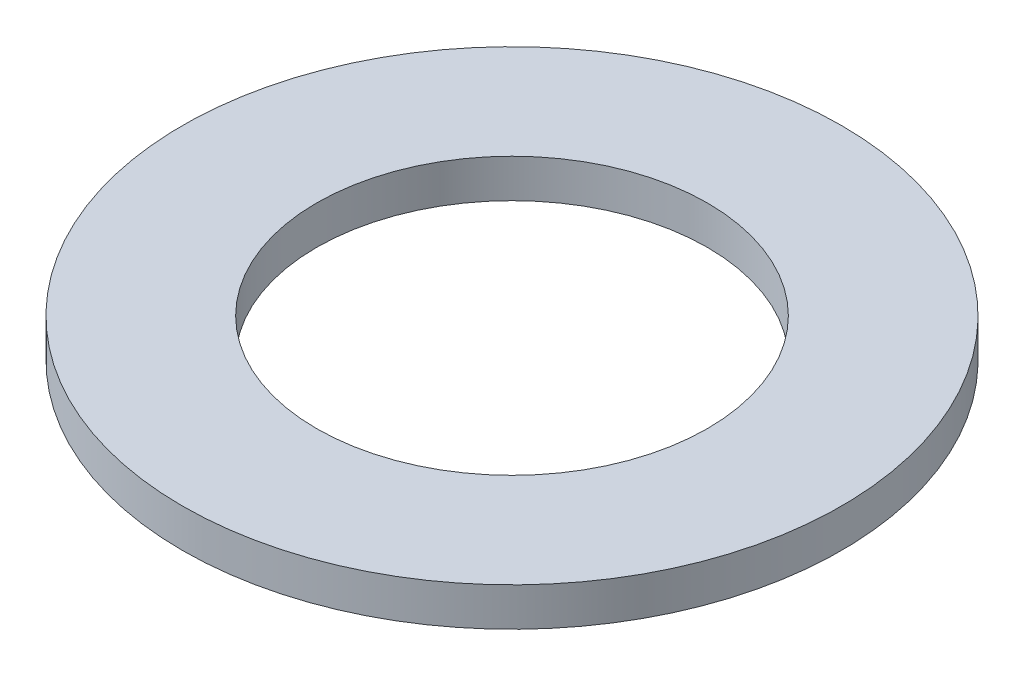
ISO-10303-21;
HEADER;
FILE_DESCRIPTION(('STEP AP214'),'2;1');
FILE_NAME('part.step','',(''),(''),'','','');
FILE_SCHEMA(('AUTOMOTIVE_DESIGN { 1 0 10303 214 1 1 1 1 }'));
ENDSEC;
DATA;
#1=APPLICATION_CONTEXT('core data for automotive mechanical design processes');
#2=APPLICATION_PROTOCOL_DEFINITION('international standard','automotive_design',2000,#1);
#3=PRODUCT_CONTEXT('',#1,'mechanical');
#4=PRODUCT('Part','Part','',(#3));
#5=PRODUCT_RELATED_PRODUCT_CATEGORY('part','',(#4));
#6=PRODUCT_DEFINITION_FORMATION('','',#4);
#7=PRODUCT_DEFINITION_CONTEXT('part definition',#1,'design');
#8=PRODUCT_DEFINITION('design','',#6,#7);
#9=PRODUCT_DEFINITION_SHAPE('','',#8);
#10=(LENGTH_UNIT() NAMED_UNIT(*) SI_UNIT(.MILLI.,.METRE.));
#11=(NAMED_UNIT(*) PLANE_ANGLE_UNIT() SI_UNIT($,.RADIAN.));
#12=(NAMED_UNIT(*) SI_UNIT($,.STERADIAN.) SOLID_ANGLE_UNIT());
#13=UNCERTAINTY_MEASURE_WITH_UNIT(LENGTH_MEASURE(1.E-05),#10,'distance_accuracy_value','');
#14=(GEOMETRIC_REPRESENTATION_CONTEXT(3) GLOBAL_UNCERTAINTY_ASSIGNED_CONTEXT((#13)) GLOBAL_UNIT_ASSIGNED_CONTEXT((#10,
#11,#12)) REPRESENTATION_CONTEXT('',''));
#15=CARTESIAN_POINT('',(0.,0.,0.));
#16=DIRECTION('',(0.,0.,1.));
#17=DIRECTION('',(1.,0.,0.));
#18=AXIS2_PLACEMENT_3D('',#15,#16,#17);
#19=CARTESIAN_POINT('',(0.,3.175,0.));
#20=DIRECTION('',(0.,-1.,0.));
#21=DIRECTION('',(0.,0.,-1.));
#22=AXIS2_PLACEMENT_3D('',#19,#20,#21);
#23=CYLINDRICAL_SURFACE('',#22,16.1163);
#24=CARTESIAN_POINT('',(0.,3.175,0.));
#25=DIRECTION('',(0.,1.,0.));
#26=DIRECTION('',(0.,0.,1.));
#27=AXIS2_PLACEMENT_3D('',#24,#25,#26);
#28=CIRCLE('',#27,16.1163);
#29=CARTESIAN_POINT('',(0.,3.175,16.1163));
#30=VERTEX_POINT('',#29);
#31=EDGE_CURVE('E38',#30,#30,#28,.T.);
#32=ORIENTED_EDGE('',*,*,#31,.T.);
#33=EDGE_LOOP('',(#32));
#34=FACE_BOUND('',#33,.T.);
#35=CARTESIAN_POINT('',(0.,0.,0.));
#36=DIRECTION('',(0.,1.,0.));
#37=DIRECTION('',(0.,0.,1.));
#38=AXIS2_PLACEMENT_3D('',#35,#36,#37);
#39=CIRCLE('',#38,16.1163);
#40=CARTESIAN_POINT('',(0.,0.,16.1163));
#41=VERTEX_POINT('',#40);
#42=EDGE_CURVE('E44',#41,#41,#39,.T.);
#43=ORIENTED_EDGE('',*,*,#42,.F.);
#44=EDGE_LOOP('',(#43));
#45=FACE_BOUND('',#44,.T.);
#46=ADVANCED_FACE('F31',(#34,#45),#23,.F.);
#47=CARTESIAN_POINT('',(0.,3.175,0.));
#48=DIRECTION('',(0.,-1.,0.));
#49=DIRECTION('',(0.,0.,-1.));
#50=AXIS2_PLACEMENT_3D('',#47,#48,#49);
#51=CYLINDRICAL_SURFACE('',#50,27.178);
#52=CARTESIAN_POINT('',(0.,3.175,0.));
#53=DIRECTION('',(0.,1.,0.));
#54=DIRECTION('',(0.,0.,1.));
#55=AXIS2_PLACEMENT_3D('',#52,#53,#54);
#56=CIRCLE('',#55,27.178);
#57=CARTESIAN_POINT('',(0.,3.175,27.178));
#58=VERTEX_POINT('',#57);
#59=EDGE_CURVE('E10',#58,#58,#56,.T.);
#60=ORIENTED_EDGE('',*,*,#59,.F.);
#61=EDGE_LOOP('',(#60));
#62=FACE_BOUND('',#61,.T.);
#63=CARTESIAN_POINT('',(0.,0.,0.));
#64=DIRECTION('',(0.,1.,0.));
#65=DIRECTION('',(0.,0.,1.));
#66=AXIS2_PLACEMENT_3D('',#63,#64,#65);
#67=CIRCLE('',#66,27.178);
#68=CARTESIAN_POINT('',(0.,0.,27.178));
#69=VERTEX_POINT('',#68);
#70=EDGE_CURVE('E34',#69,#69,#67,.T.);
#71=ORIENTED_EDGE('',*,*,#70,.T.);
#72=EDGE_LOOP('',(#71));
#73=FACE_BOUND('',#72,.T.);
#74=ADVANCED_FACE('F51',(#62,#73),#51,.T.);
#75=CARTESIAN_POINT('',(0.,3.175,0.));
#76=DIRECTION('',(0.,1.,0.));
#77=DIRECTION('',(0.,0.,1.));
#78=AXIS2_PLACEMENT_3D('',#75,#76,#77);
#79=PLANE('',#78);
#80=ORIENTED_EDGE('',*,*,#31,.F.);
#81=EDGE_LOOP('',(#80));
#82=FACE_BOUND('',#81,.T.);
#83=ORIENTED_EDGE('',*,*,#59,.T.);
#84=EDGE_LOOP('',(#83));
#85=FACE_BOUND('',#84,.T.);
#86=ADVANCED_FACE('F55',(#82,#85),#79,.T.);
#87=CARTESIAN_POINT('',(0.,0.,0.));
#88=DIRECTION('',(0.,1.,0.));
#89=DIRECTION('',(0.,0.,1.));
#90=AXIS2_PLACEMENT_3D('',#87,#88,#89);
#91=PLANE('',#90);
#92=ORIENTED_EDGE('',*,*,#42,.T.);
#93=EDGE_LOOP('',(#92));
#94=FACE_BOUND('',#93,.T.);
#95=ORIENTED_EDGE('',*,*,#70,.F.);
#96=EDGE_LOOP('',(#95));
#97=FACE_BOUND('',#96,.T.);
#98=ADVANCED_FACE('F53',(#94,#97),#91,.F.);
#99=CLOSED_SHELL('',(#46,#74,#86,#98));
#100=MANIFOLD_SOLID_BREP('B2',#99);
#101=ADVANCED_BREP_SHAPE_REPRESENTATION('',(#18,#100),#14);
#102=SHAPE_DEFINITION_REPRESENTATION(#9,#101);
ENDSEC;
END-ISO-10303-21;
